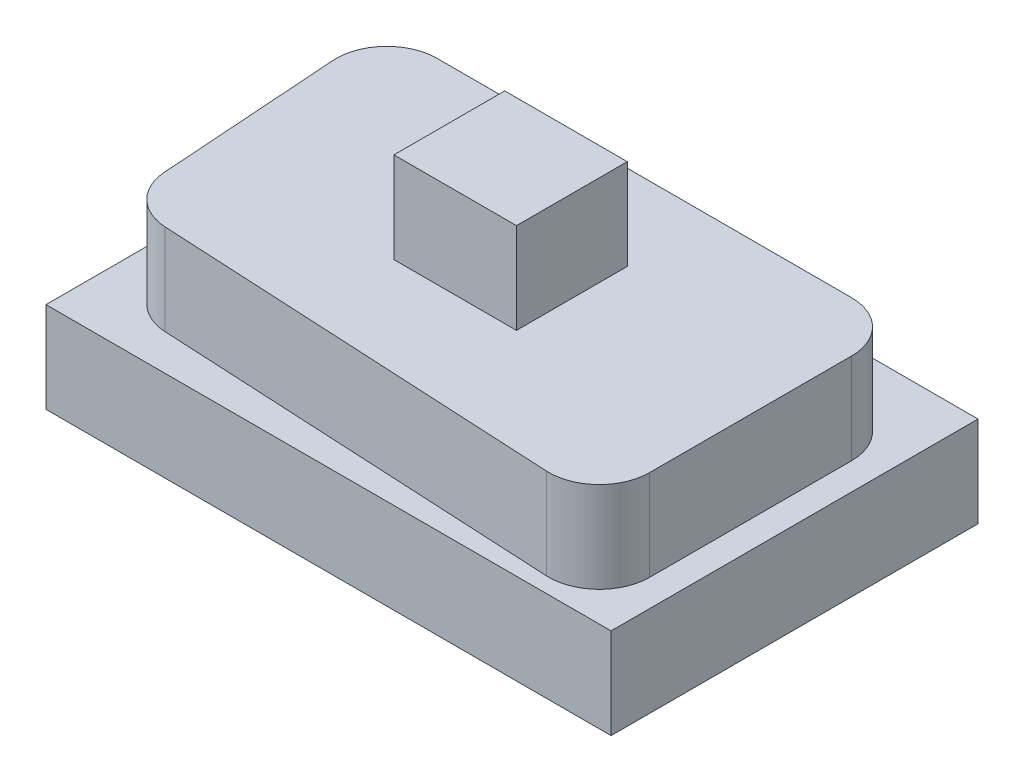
ISO-10303-21;
HEADER;
FILE_DESCRIPTION(('STEP AP214'),'2;1');
FILE_NAME('part.step','',(''),(''),'','','');
FILE_SCHEMA(('AUTOMOTIVE_DESIGN { 1 0 10303 214 1 1 1 1 }'));
ENDSEC;
DATA;
#1=APPLICATION_CONTEXT('core data for automotive mechanical design processes');
#2=APPLICATION_PROTOCOL_DEFINITION('international standard','automotive_design',2000,#1);
#3=PRODUCT_CONTEXT('',#1,'mechanical');
#4=PRODUCT('Part','Part','',(#3));
#5=PRODUCT_RELATED_PRODUCT_CATEGORY('part','',(#4));
#6=PRODUCT_DEFINITION_FORMATION('','',#4);
#7=PRODUCT_DEFINITION_CONTEXT('part definition',#1,'design');
#8=PRODUCT_DEFINITION('design','',#6,#7);
#9=PRODUCT_DEFINITION_SHAPE('','',#8);
#10=(LENGTH_UNIT() NAMED_UNIT(*) SI_UNIT(.MILLI.,.METRE.));
#11=(NAMED_UNIT(*) PLANE_ANGLE_UNIT() SI_UNIT($,.RADIAN.));
#12=(NAMED_UNIT(*) SI_UNIT($,.STERADIAN.) SOLID_ANGLE_UNIT());
#13=UNCERTAINTY_MEASURE_WITH_UNIT(LENGTH_MEASURE(1.E-05),#10,'distance_accuracy_value','');
#14=(GEOMETRIC_REPRESENTATION_CONTEXT(3) GLOBAL_UNCERTAINTY_ASSIGNED_CONTEXT((#13)) GLOBAL_UNIT_ASSIGNED_CONTEXT((#10,
#11,#12)) REPRESENTATION_CONTEXT('',''));
#15=CARTESIAN_POINT('',(0.,0.,0.));
#16=DIRECTION('',(0.,0.,1.));
#17=DIRECTION('',(1.,0.,0.));
#18=AXIS2_PLACEMENT_3D('',#15,#16,#17);
#19=CARTESIAN_POINT('',(0.,9.,0.));
#20=DIRECTION('',(0.,-1.,0.));
#21=DIRECTION('',(0.,0.,-1.));
#22=AXIS2_PLACEMENT_3D('',#19,#20,#21);
#23=PLANE('',#22);
#24=DIRECTION('',(0.,0.,1.));
#25=VECTOR('',#24,1.);
#26=CARTESIAN_POINT('',(0.,9.,0.));
#27=LINE('',#26,#25);
#28=CARTESIAN_POINT('',(0.,9.,-36.3918895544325));
#29=VERTEX_POINT('',#28);
#30=CARTESIAN_POINT('',(0.,9.,0.));
#31=VERTEX_POINT('',#30);
#32=EDGE_CURVE('E198',#29,#31,#27,.T.);
#33=ORIENTED_EDGE('',*,*,#32,.T.);
#34=DIRECTION('',(1.,0.,0.));
#35=VECTOR('',#34,1.);
#36=CARTESIAN_POINT('',(0.,9.,0.));
#37=LINE('',#36,#35);
#38=CARTESIAN_POINT('',(56.0446144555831,9.,0.));
#39=VERTEX_POINT('',#38);
#40=EDGE_CURVE('E201',#31,#39,#37,.T.);
#41=ORIENTED_EDGE('',*,*,#40,.T.);
#42=DIRECTION('',(0.,0.,-1.));
#43=VECTOR('',#42,1.);
#44=CARTESIAN_POINT('',(56.0446144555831,9.,0.));
#45=LINE('',#44,#43);
#46=CARTESIAN_POINT('',(56.0446144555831,9.,-36.3918895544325));
#47=VERTEX_POINT('',#46);
#48=EDGE_CURVE('E204',#39,#47,#45,.T.);
#49=ORIENTED_EDGE('',*,*,#48,.T.);
#50=DIRECTION('',(-1.,0.,0.));
#51=VECTOR('',#50,1.);
#52=CARTESIAN_POINT('',(0.,9.,-36.3918895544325));
#53=LINE('',#52,#51);
#54=EDGE_CURVE('E206',#47,#29,#53,.T.);
#55=ORIENTED_EDGE('',*,*,#54,.T.);
#56=EDGE_LOOP('',(#33,#41,#49,#55));
#57=FACE_BOUND('',#56,.T.);
#58=DIRECTION('',(0.998668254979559,0.,0.0515918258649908));
#59=VECTOR('',#58,1.);
#60=CARTESIAN_POINT('',(3.81,9.,-3.81));
#61=LINE('',#60,#59);
#62=CARTESIAN_POINT('',(8.23375056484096,9.,-3.58146628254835));
#63=VERTEX_POINT('',#62);
#64=CARTESIAN_POINT('',(48.1021339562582,9.,-1.52184069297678));
#65=VERTEX_POINT('',#64);
#66=EDGE_CURVE('E169',#63,#65,#61,.T.);
#67=ORIENTED_EDGE('',*,*,#66,.F.);
#68=CARTESIAN_POINT('',(8.49170969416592,9.,-8.57480755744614));
#69=DIRECTION('',(0.,-1.,0.));
#70=DIRECTION('',(0.,0.,-1.));
#71=AXIS2_PLACEMENT_3D('',#68,#69,#70);
#72=CIRCLE('',#71,5.);
#73=CARTESIAN_POINT('',(3.50367915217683,9.,-8.22904562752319));
#74=VERTEX_POINT('',#73);
#75=EDGE_CURVE('E11',#63,#74,#72,.T.);
#76=ORIENTED_EDGE('',*,*,#75,.T.);
#77=DIRECTION('',(0.0691523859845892,0.,0.997606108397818));
#78=VECTOR('',#77,1.);
#79=CARTESIAN_POINT('',(1.88737663,9.,-31.5461480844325));
#80=LINE('',#79,#78);
#81=CARTESIAN_POINT('',(2.25793590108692,9.,-26.2003861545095));
#82=VERTEX_POINT('',#81);
#83=EDGE_CURVE('E181',#82,#74,#80,.T.);
#84=ORIENTED_EDGE('',*,*,#83,.F.);
#85=CARTESIAN_POINT('',(7.24596644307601,9.,-26.5461480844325));
#86=DIRECTION('',(0.,-1.,0.));
#87=DIRECTION('',(0.,0.,-1.));
#88=AXIS2_PLACEMENT_3D('',#85,#86,#87);
#89=CIRCLE('',#88,5.);
#90=CARTESIAN_POINT('',(7.24596644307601,9.,-31.5461480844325));
#91=VERTEX_POINT('',#90);
#92=EDGE_CURVE('E254',#82,#91,#89,.T.);
#93=ORIENTED_EDGE('',*,*,#92,.T.);
#94=DIRECTION('',(-1.,0.,0.));
#95=VECTOR('',#94,1.);
#96=CARTESIAN_POINT('',(53.3600930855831,9.,-31.5461480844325));
#97=LINE('',#96,#95);
#98=CARTESIAN_POINT('',(48.3600930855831,9.,-31.5461480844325));
#99=VERTEX_POINT('',#98);
#100=EDGE_CURVE('E193',#99,#91,#97,.T.);
#101=ORIENTED_EDGE('',*,*,#100,.F.);
#102=CARTESIAN_POINT('',(48.3600930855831,9.,-26.5461480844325));
#103=DIRECTION('',(0.,-1.,0.));
#104=DIRECTION('',(0.,0.,-1.));
#105=AXIS2_PLACEMENT_3D('',#102,#103,#104);
#106=CIRCLE('',#105,5.);
#107=CARTESIAN_POINT('',(53.3600930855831,9.,-26.5461480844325));
#108=VERTEX_POINT('',#107);
#109=EDGE_CURVE('E256',#99,#108,#106,.T.);
#110=ORIENTED_EDGE('',*,*,#109,.T.);
#111=DIRECTION('',(0.,0.,-1.));
#112=VECTOR('',#111,1.);
#113=CARTESIAN_POINT('',(53.3600930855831,9.,-1.25021124));
#114=LINE('',#113,#112);
#115=CARTESIAN_POINT('',(53.3600930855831,9.,-6.51518196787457));
#116=VERTEX_POINT('',#115);
#117=EDGE_CURVE('E171',#116,#108,#114,.T.);
#118=ORIENTED_EDGE('',*,*,#117,.F.);
#119=CARTESIAN_POINT('',(48.3600930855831,9.,-6.51518196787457));
#120=DIRECTION('',(0.,-1.,0.));
#121=DIRECTION('',(0.,0.,-1.));
#122=AXIS2_PLACEMENT_3D('',#119,#120,#121);
#123=CIRCLE('',#122,5.);
#124=EDGE_CURVE('E40',#116,#65,#123,.T.);
#125=ORIENTED_EDGE('',*,*,#124,.T.);
#126=EDGE_LOOP('',(#67,#76,#84,#93,#101,#110,#118,#125));
#127=FACE_BOUND('',#126,.T.);
#128=ADVANCED_FACE('F32',(#57,#127),#23,.F.);
#129=CARTESIAN_POINT('',(0.,9.,0.));
#130=DIRECTION('',(1.,0.,0.));
#131=DIRECTION('',(0.,0.,-1.));
#132=AXIS2_PLACEMENT_3D('',#129,#130,#131);
#133=PLANE('',#132);
#134=DIRECTION('',(0.,0.,1.));
#135=VECTOR('',#134,1.);
#136=CARTESIAN_POINT('',(0.,0.,0.));
#137=LINE('',#136,#135);
#138=CARTESIAN_POINT('',(0.,0.,-36.3918895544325));
#139=VERTEX_POINT('',#138);
#140=CARTESIAN_POINT('',(0.,0.,0.));
#141=VERTEX_POINT('',#140);
#142=EDGE_CURVE('E189',#139,#141,#137,.T.);
#143=ORIENTED_EDGE('',*,*,#142,.T.);
#144=DIRECTION('',(0.,-1.,0.));
#145=VECTOR('',#144,1.);
#146=CARTESIAN_POINT('',(0.,9.,0.));
#147=LINE('',#146,#145);
#148=EDGE_CURVE('E224',#31,#141,#147,.T.);
#149=ORIENTED_EDGE('',*,*,#148,.F.);
#150=ORIENTED_EDGE('',*,*,#32,.F.);
#151=DIRECTION('',(0.,-1.,0.));
#152=VECTOR('',#151,1.);
#153=CARTESIAN_POINT('',(0.,9.,-36.3918895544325));
#154=LINE('',#153,#152);
#155=EDGE_CURVE('E208',#29,#139,#154,.T.);
#156=ORIENTED_EDGE('',*,*,#155,.T.);
#157=EDGE_LOOP('',(#143,#149,#150,#156));
#158=FACE_BOUND('',#157,.T.);
#159=ADVANCED_FACE('F296',(#158),#133,.F.);
#160=CARTESIAN_POINT('',(0.,9.,0.));
#161=DIRECTION('',(0.,0.,-1.));
#162=DIRECTION('',(-1.,0.,0.));
#163=AXIS2_PLACEMENT_3D('',#160,#161,#162);
#164=PLANE('',#163);
#165=DIRECTION('',(1.,0.,0.));
#166=VECTOR('',#165,1.);
#167=CARTESIAN_POINT('',(0.,0.,0.));
#168=LINE('',#167,#166);
#169=CARTESIAN_POINT('',(56.0446144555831,0.,0.));
#170=VERTEX_POINT('',#169);
#171=EDGE_CURVE('E211',#141,#170,#168,.T.);
#172=ORIENTED_EDGE('',*,*,#171,.T.);
#173=DIRECTION('',(0.,-1.,0.));
#174=VECTOR('',#173,1.);
#175=CARTESIAN_POINT('',(56.0446144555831,9.,0.));
#176=LINE('',#175,#174);
#177=EDGE_CURVE('E221',#39,#170,#176,.T.);
#178=ORIENTED_EDGE('',*,*,#177,.F.);
#179=ORIENTED_EDGE('',*,*,#40,.F.);
#180=ORIENTED_EDGE('',*,*,#148,.T.);
#181=EDGE_LOOP('',(#172,#178,#179,#180));
#182=FACE_BOUND('',#181,.T.);
#183=ADVANCED_FACE('F302',(#182),#164,.F.);
#184=CARTESIAN_POINT('',(56.0446144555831,9.,0.));
#185=DIRECTION('',(-1.,0.,0.));
#186=DIRECTION('',(0.,0.,1.));
#187=AXIS2_PLACEMENT_3D('',#184,#185,#186);
#188=PLANE('',#187);
#189=DIRECTION('',(0.,0.,-1.));
#190=VECTOR('',#189,1.);
#191=CARTESIAN_POINT('',(56.0446144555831,0.,0.));
#192=LINE('',#191,#190);
#193=CARTESIAN_POINT('',(56.0446144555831,0.,-36.3918895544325));
#194=VERTEX_POINT('',#193);
#195=EDGE_CURVE('E213',#170,#194,#192,.T.);
#196=ORIENTED_EDGE('',*,*,#195,.T.);
#197=DIRECTION('',(0.,-1.,0.));
#198=VECTOR('',#197,1.);
#199=CARTESIAN_POINT('',(56.0446144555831,9.,-36.3918895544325));
#200=LINE('',#199,#198);
#201=EDGE_CURVE('E218',#47,#194,#200,.T.);
#202=ORIENTED_EDGE('',*,*,#201,.F.);
#203=ORIENTED_EDGE('',*,*,#48,.F.);
#204=ORIENTED_EDGE('',*,*,#177,.T.);
#205=EDGE_LOOP('',(#196,#202,#203,#204));
#206=FACE_BOUND('',#205,.T.);
#207=ADVANCED_FACE('F315',(#206),#188,.F.);
#208=CARTESIAN_POINT('',(0.,9.,-36.3918895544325));
#209=DIRECTION('',(0.,0.,1.));
#210=DIRECTION('',(1.,0.,0.));
#211=AXIS2_PLACEMENT_3D('',#208,#209,#210);
#212=PLANE('',#211);
#213=DIRECTION('',(-1.,0.,0.));
#214=VECTOR('',#213,1.);
#215=CARTESIAN_POINT('',(0.,0.,-36.3918895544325));
#216=LINE('',#215,#214);
#217=EDGE_CURVE('E202',#194,#139,#216,.T.);
#218=ORIENTED_EDGE('',*,*,#217,.T.);
#219=ORIENTED_EDGE('',*,*,#155,.F.);
#220=ORIENTED_EDGE('',*,*,#54,.F.);
#221=ORIENTED_EDGE('',*,*,#201,.T.);
#222=EDGE_LOOP('',(#218,#219,#220,#221));
#223=FACE_BOUND('',#222,.T.);
#224=ADVANCED_FACE('F311',(#223),#212,.F.);
#225=CARTESIAN_POINT('',(0.,0.,0.));
#226=DIRECTION('',(0.,-1.,0.));
#227=DIRECTION('',(0.,0.,-1.));
#228=AXIS2_PLACEMENT_3D('',#225,#226,#227);
#229=PLANE('',#228);
#230=ORIENTED_EDGE('',*,*,#142,.F.);
#231=ORIENTED_EDGE('',*,*,#217,.F.);
#232=ORIENTED_EDGE('',*,*,#195,.F.);
#233=ORIENTED_EDGE('',*,*,#171,.F.);
#234=EDGE_LOOP('',(#230,#231,#232,#233));
#235=FACE_BOUND('',#234,.T.);
#236=ADVANCED_FACE('F308',(#235),#229,.T.);
#237=CARTESIAN_POINT('',(3.81,18.,-3.81));
#238=DIRECTION('',(0.0515918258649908,0.,-0.998668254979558));
#239=DIRECTION('',(-0.998668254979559,0.,-0.0515918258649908));
#240=AXIS2_PLACEMENT_3D('',#237,#238,#239);
#241=PLANE('',#240);
#242=ORIENTED_EDGE('',*,*,#66,.T.);
#243=DIRECTION('',(0.,-1.,0.));
#244=VECTOR('',#243,1.);
#245=CARTESIAN_POINT('',(48.1021339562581,18.,-1.52184069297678));
#246=LINE('',#245,#244);
#247=CARTESIAN_POINT('',(48.1021339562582,18.,-1.52184069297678));
#248=VERTEX_POINT('',#247);
#249=EDGE_CURVE('E252',#65,#248,#246,.F.);
#250=ORIENTED_EDGE('',*,*,#249,.T.);
#251=DIRECTION('',(0.998668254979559,0.,0.0515918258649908));
#252=VECTOR('',#251,1.);
#253=CARTESIAN_POINT('',(3.81,18.,-3.81));
#254=LINE('',#253,#252);
#255=CARTESIAN_POINT('',(8.23375056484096,18.,-3.58146628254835));
#256=VERTEX_POINT('',#255);
#257=EDGE_CURVE('E177',#256,#248,#254,.T.);
#258=ORIENTED_EDGE('',*,*,#257,.F.);
#259=DIRECTION('',(0.,-1.,0.));
#260=VECTOR('',#259,1.);
#261=CARTESIAN_POINT('',(8.23375056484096,18.,-3.58146628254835));
#262=LINE('',#261,#260);
#263=EDGE_CURVE('E250',#256,#63,#262,.T.);
#264=ORIENTED_EDGE('',*,*,#263,.T.);
#265=EDGE_LOOP('',(#242,#250,#258,#264));
#266=FACE_BOUND('',#265,.T.);
#267=ADVANCED_FACE('F285',(#266),#241,.F.);
#268=CARTESIAN_POINT('',(53.3600930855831,18.,-1.25021124));
#269=DIRECTION('',(-1.,0.,0.));
#270=DIRECTION('',(0.,0.,1.));
#271=AXIS2_PLACEMENT_3D('',#268,#269,#270);
#272=PLANE('',#271);
#273=ORIENTED_EDGE('',*,*,#117,.T.);
#274=DIRECTION('',(0.,-1.,0.));
#275=VECTOR('',#274,1.);
#276=CARTESIAN_POINT('',(53.3600930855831,18.,-26.5461480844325));
#277=LINE('',#276,#275);
#278=CARTESIAN_POINT('',(53.3600930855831,18.,-26.5461480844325));
#279=VERTEX_POINT('',#278);
#280=EDGE_CURVE('E248',#108,#279,#277,.F.);
#281=ORIENTED_EDGE('',*,*,#280,.T.);
#282=DIRECTION('',(0.,0.,-1.));
#283=VECTOR('',#282,1.);
#284=CARTESIAN_POINT('',(53.3600930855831,18.,-1.25021124));
#285=LINE('',#284,#283);
#286=CARTESIAN_POINT('',(53.3600930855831,18.,-6.51518196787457));
#287=VERTEX_POINT('',#286);
#288=EDGE_CURVE('E180',#287,#279,#285,.T.);
#289=ORIENTED_EDGE('',*,*,#288,.F.);
#290=DIRECTION('',(0.,-1.,0.));
#291=VECTOR('',#290,1.);
#292=CARTESIAN_POINT('',(53.3600930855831,18.,-6.51518196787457));
#293=LINE('',#292,#291);
#294=EDGE_CURVE('E245',#287,#116,#293,.T.);
#295=ORIENTED_EDGE('',*,*,#294,.T.);
#296=EDGE_LOOP('',(#273,#281,#289,#295));
#297=FACE_BOUND('',#296,.T.);
#298=ADVANCED_FACE('F262',(#297),#272,.F.);
#299=CARTESIAN_POINT('',(53.3600930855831,18.,-31.5461480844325));
#300=DIRECTION('',(0.,0.,1.));
#301=DIRECTION('',(1.,0.,0.));
#302=AXIS2_PLACEMENT_3D('',#299,#300,#301);
#303=PLANE('',#302);
#304=ORIENTED_EDGE('',*,*,#100,.T.);
#305=DIRECTION('',(0.,-1.,0.));
#306=VECTOR('',#305,1.);
#307=CARTESIAN_POINT('',(7.24596644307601,18.,-31.5461480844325));
#308=LINE('',#307,#306);
#309=CARTESIAN_POINT('',(7.24596644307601,18.,-31.5461480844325));
#310=VERTEX_POINT('',#309);
#311=EDGE_CURVE('E235',#91,#310,#308,.F.);
#312=ORIENTED_EDGE('',*,*,#311,.T.);
#313=DIRECTION('',(-1.,0.,0.));
#314=VECTOR('',#313,1.);
#315=CARTESIAN_POINT('',(53.3600930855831,18.,-31.5461480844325));
#316=LINE('',#315,#314);
#317=CARTESIAN_POINT('',(48.3600930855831,18.,-31.5461480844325));
#318=VERTEX_POINT('',#317);
#319=EDGE_CURVE('E184',#318,#310,#316,.T.);
#320=ORIENTED_EDGE('',*,*,#319,.F.);
#321=DIRECTION('',(0.,-1.,0.));
#322=VECTOR('',#321,1.);
#323=CARTESIAN_POINT('',(48.3600930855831,18.,-31.5461480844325));
#324=LINE('',#323,#322);
#325=EDGE_CURVE('E232',#318,#99,#324,.T.);
#326=ORIENTED_EDGE('',*,*,#325,.T.);
#327=EDGE_LOOP('',(#304,#312,#320,#326));
#328=FACE_BOUND('',#327,.T.);
#329=ADVANCED_FACE('F272',(#328),#303,.F.);
#330=CARTESIAN_POINT('',(1.88737663,18.,-31.5461480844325));
#331=DIRECTION('',(0.997606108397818,0.,-0.0691523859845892));
#332=DIRECTION('',(-0.0691523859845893,0.,-0.997606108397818));
#333=AXIS2_PLACEMENT_3D('',#330,#331,#332);
#334=PLANE('',#333);
#335=DIRECTION('',(0.0691523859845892,0.,0.997606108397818));
#336=VECTOR('',#335,1.);
#337=CARTESIAN_POINT('',(1.88737663,18.,-31.5461480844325));
#338=LINE('',#337,#336);
#339=CARTESIAN_POINT('',(2.25793590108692,18.,-26.2003861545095));
#340=VERTEX_POINT('',#339);
#341=CARTESIAN_POINT('',(3.50367915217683,18.,-8.22904562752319));
#342=VERTEX_POINT('',#341);
#343=EDGE_CURVE('E187',#340,#342,#338,.T.);
#344=ORIENTED_EDGE('',*,*,#343,.F.);
#345=DIRECTION('',(0.,-1.,0.));
#346=VECTOR('',#345,1.);
#347=CARTESIAN_POINT('',(2.25793590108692,18.,-26.2003861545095));
#348=LINE('',#347,#346);
#349=EDGE_CURVE('E229',#340,#82,#348,.T.);
#350=ORIENTED_EDGE('',*,*,#349,.T.);
#351=ORIENTED_EDGE('',*,*,#83,.T.);
#352=DIRECTION('',(0.,-1.,0.));
#353=VECTOR('',#352,1.);
#354=CARTESIAN_POINT('',(3.50367915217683,18.,-8.2290456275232));
#355=LINE('',#354,#353);
#356=EDGE_CURVE('E227',#74,#342,#355,.F.);
#357=ORIENTED_EDGE('',*,*,#356,.T.);
#358=EDGE_LOOP('',(#344,#350,#351,#357));
#359=FACE_BOUND('',#358,.T.);
#360=ADVANCED_FACE('F280',(#359),#334,.F.);
#361=CARTESIAN_POINT('',(0.,18.,0.));
#362=DIRECTION('',(0.,1.,0.));
#363=DIRECTION('',(0.,0.,1.));
#364=AXIS2_PLACEMENT_3D('',#361,#362,#363);
#365=PLANE('',#364);
#366=DIRECTION('',(0.,0.,1.));
#367=VECTOR('',#366,1.);
#368=CARTESIAN_POINT('',(22.39082313,18.,-23.10569041));
#369=LINE('',#368,#367);
#370=CARTESIAN_POINT('',(22.39082313,18.,-23.10569041));
#371=VERTEX_POINT('',#370);
#372=CARTESIAN_POINT('',(22.39082313,18.,-12.11705413));
#373=VERTEX_POINT('',#372);
#374=EDGE_CURVE('E168',#371,#373,#369,.T.);
#375=ORIENTED_EDGE('',*,*,#374,.F.);
#376=DIRECTION('',(-1.,0.,0.));
#377=VECTOR('',#376,1.);
#378=CARTESIAN_POINT('',(22.39082313,18.,-23.10569041));
#379=LINE('',#378,#377);
#380=CARTESIAN_POINT('',(34.5461071,18.,-23.10569041));
#381=VERTEX_POINT('',#380);
#382=EDGE_CURVE('E165',#381,#371,#379,.T.);
#383=ORIENTED_EDGE('',*,*,#382,.F.);
#384=DIRECTION('',(0.,0.,-1.));
#385=VECTOR('',#384,1.);
#386=CARTESIAN_POINT('',(34.5461071,18.,-23.10569041));
#387=LINE('',#386,#385);
#388=CARTESIAN_POINT('',(34.5461071,18.,-12.11705413));
#389=VERTEX_POINT('',#388);
#390=EDGE_CURVE('E470',#389,#381,#387,.T.);
#391=ORIENTED_EDGE('',*,*,#390,.F.);
#392=DIRECTION('',(1.,0.,0.));
#393=VECTOR('',#392,1.);
#394=CARTESIAN_POINT('',(22.39082313,18.,-12.11705413));
#395=LINE('',#394,#393);
#396=EDGE_CURVE('E465',#373,#389,#395,.T.);
#397=ORIENTED_EDGE('',*,*,#396,.F.);
#398=EDGE_LOOP('',(#375,#383,#391,#397));
#399=FACE_BOUND('',#398,.T.);
#400=ORIENTED_EDGE('',*,*,#319,.T.);
#401=CARTESIAN_POINT('',(7.24596644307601,18.,-26.5461480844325));
#402=DIRECTION('',(0.,1.,0.));
#403=DIRECTION('',(0.,0.,1.));
#404=AXIS2_PLACEMENT_3D('',#401,#402,#403);
#405=CIRCLE('',#404,5.);
#406=EDGE_CURVE('E243',#310,#340,#405,.T.);
#407=ORIENTED_EDGE('',*,*,#406,.T.);
#408=ORIENTED_EDGE('',*,*,#343,.T.);
#409=CARTESIAN_POINT('',(8.49170969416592,18.,-8.57480755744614));
#410=DIRECTION('',(0.,1.,0.));
#411=DIRECTION('',(0.,0.,1.));
#412=AXIS2_PLACEMENT_3D('',#409,#410,#411);
#413=CIRCLE('',#412,5.);
#414=EDGE_CURVE('E237',#342,#256,#413,.T.);
#415=ORIENTED_EDGE('',*,*,#414,.T.);
#416=ORIENTED_EDGE('',*,*,#257,.T.);
#417=CARTESIAN_POINT('',(48.3600930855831,18.,-6.51518196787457));
#418=DIRECTION('',(0.,1.,0.));
#419=DIRECTION('',(0.,0.,1.));
#420=AXIS2_PLACEMENT_3D('',#417,#418,#419);
#421=CIRCLE('',#420,5.);
#422=EDGE_CURVE('E239',#248,#287,#421,.T.);
#423=ORIENTED_EDGE('',*,*,#422,.T.);
#424=ORIENTED_EDGE('',*,*,#288,.T.);
#425=CARTESIAN_POINT('',(48.3600930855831,18.,-26.5461480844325));
#426=DIRECTION('',(0.,1.,0.));
#427=DIRECTION('',(0.,0.,1.));
#428=AXIS2_PLACEMENT_3D('',#425,#426,#427);
#429=CIRCLE('',#428,5.);
#430=EDGE_CURVE('E241',#279,#318,#429,.T.);
#431=ORIENTED_EDGE('',*,*,#430,.T.);
#432=EDGE_LOOP('',(#400,#407,#408,#415,#416,#423,#424,#431));
#433=FACE_BOUND('',#432,.T.);
#434=ADVANCED_FACE('F269',(#399,#433),#365,.T.);
#435=CARTESIAN_POINT('',(22.39082313,27.,-23.10569041));
#436=DIRECTION('',(1.,0.,0.));
#437=DIRECTION('',(0.,0.,-1.));
#438=AXIS2_PLACEMENT_3D('',#435,#436,#437);
#439=PLANE('',#438);
#440=ORIENTED_EDGE('',*,*,#374,.T.);
#441=DIRECTION('',(0.,-1.,0.));
#442=VECTOR('',#441,1.);
#443=CARTESIAN_POINT('',(22.39082313,27.,-12.11705413));
#444=LINE('',#443,#442);
#445=CARTESIAN_POINT('',(22.39082313,27.,-12.11705413));
#446=VERTEX_POINT('',#445);
#447=EDGE_CURVE('E149',#446,#373,#444,.T.);
#448=ORIENTED_EDGE('',*,*,#447,.F.);
#449=DIRECTION('',(0.,0.,1.));
#450=VECTOR('',#449,1.);
#451=CARTESIAN_POINT('',(22.39082313,27.,-23.10569041));
#452=LINE('',#451,#450);
#453=CARTESIAN_POINT('',(22.39082313,27.,-23.10569041));
#454=VERTEX_POINT('',#453);
#455=EDGE_CURVE('E156',#454,#446,#452,.T.);
#456=ORIENTED_EDGE('',*,*,#455,.F.);
#457=DIRECTION('',(0.,-1.,0.));
#458=VECTOR('',#457,1.);
#459=CARTESIAN_POINT('',(22.39082313,27.,-23.10569041));
#460=LINE('',#459,#458);
#461=EDGE_CURVE('E468',#454,#371,#460,.T.);
#462=ORIENTED_EDGE('',*,*,#461,.T.);
#463=EDGE_LOOP('',(#440,#448,#456,#462));
#464=FACE_BOUND('',#463,.T.);
#465=ADVANCED_FACE('F167',(#464),#439,.F.);
#466=CARTESIAN_POINT('',(22.39082313,27.,-12.11705413));
#467=DIRECTION('',(0.,0.,-1.));
#468=DIRECTION('',(-1.,0.,0.));
#469=AXIS2_PLACEMENT_3D('',#466,#467,#468);
#470=PLANE('',#469);
#471=ORIENTED_EDGE('',*,*,#396,.T.);
#472=DIRECTION('',(0.,-1.,0.));
#473=VECTOR('',#472,1.);
#474=CARTESIAN_POINT('',(34.5461071,27.,-12.11705413));
#475=LINE('',#474,#473);
#476=CARTESIAN_POINT('',(34.5461071,27.,-12.11705413));
#477=VERTEX_POINT('',#476);
#478=EDGE_CURVE('E152',#477,#389,#475,.T.);
#479=ORIENTED_EDGE('',*,*,#478,.F.);
#480=DIRECTION('',(1.,0.,0.));
#481=VECTOR('',#480,1.);
#482=CARTESIAN_POINT('',(22.39082313,27.,-12.11705413));
#483=LINE('',#482,#481);
#484=EDGE_CURVE('E144',#446,#477,#483,.T.);
#485=ORIENTED_EDGE('',*,*,#484,.F.);
#486=ORIENTED_EDGE('',*,*,#447,.T.);
#487=EDGE_LOOP('',(#471,#479,#485,#486));
#488=FACE_BOUND('',#487,.T.);
#489=ADVANCED_FACE('F147',(#488),#470,.F.);
#490=CARTESIAN_POINT('',(34.5461071,27.,-23.10569041));
#491=DIRECTION('',(-1.,0.,0.));
#492=DIRECTION('',(0.,0.,1.));
#493=AXIS2_PLACEMENT_3D('',#490,#491,#492);
#494=PLANE('',#493);
#495=ORIENTED_EDGE('',*,*,#390,.T.);
#496=DIRECTION('',(0.,-1.,0.));
#497=VECTOR('',#496,1.);
#498=CARTESIAN_POINT('',(34.5461071,27.,-23.10569041));
#499=LINE('',#498,#497);
#500=CARTESIAN_POINT('',(34.5461071,27.,-23.10569041));
#501=VERTEX_POINT('',#500);
#502=EDGE_CURVE('E173',#501,#381,#499,.T.);
#503=ORIENTED_EDGE('',*,*,#502,.F.);
#504=DIRECTION('',(0.,0.,-1.));
#505=VECTOR('',#504,1.);
#506=CARTESIAN_POINT('',(34.5461071,27.,-23.10569041));
#507=LINE('',#506,#505);
#508=EDGE_CURVE('E155',#477,#501,#507,.T.);
#509=ORIENTED_EDGE('',*,*,#508,.F.);
#510=ORIENTED_EDGE('',*,*,#478,.T.);
#511=EDGE_LOOP('',(#495,#503,#509,#510));
#512=FACE_BOUND('',#511,.T.);
#513=ADVANCED_FACE('F332',(#512),#494,.F.);
#514=CARTESIAN_POINT('',(22.39082313,27.,-23.10569041));
#515=DIRECTION('',(0.,0.,1.));
#516=DIRECTION('',(1.,0.,0.));
#517=AXIS2_PLACEMENT_3D('',#514,#515,#516);
#518=PLANE('',#517);
#519=ORIENTED_EDGE('',*,*,#382,.T.);
#520=ORIENTED_EDGE('',*,*,#461,.F.);
#521=DIRECTION('',(-1.,0.,0.));
#522=VECTOR('',#521,1.);
#523=CARTESIAN_POINT('',(22.39082313,27.,-23.10569041));
#524=LINE('',#523,#522);
#525=EDGE_CURVE('E161',#501,#454,#524,.T.);
#526=ORIENTED_EDGE('',*,*,#525,.F.);
#527=ORIENTED_EDGE('',*,*,#502,.T.);
#528=EDGE_LOOP('',(#519,#520,#526,#527));
#529=FACE_BOUND('',#528,.T.);
#530=ADVANCED_FACE('F327',(#529),#518,.F.);
#531=CARTESIAN_POINT('',(0.,27.,0.));
#532=DIRECTION('',(0.,1.,0.));
#533=DIRECTION('',(0.,0.,1.));
#534=AXIS2_PLACEMENT_3D('',#531,#532,#533);
#535=PLANE('',#534);
#536=ORIENTED_EDGE('',*,*,#455,.T.);
#537=ORIENTED_EDGE('',*,*,#484,.T.);
#538=ORIENTED_EDGE('',*,*,#508,.T.);
#539=ORIENTED_EDGE('',*,*,#525,.T.);
#540=EDGE_LOOP('',(#536,#537,#538,#539));
#541=FACE_BOUND('',#540,.T.);
#542=ADVANCED_FACE('F159',(#541),#535,.T.);
#543=CARTESIAN_POINT('',(7.24596644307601,18.,-26.5461480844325));
#544=DIRECTION('',(0.,-1.,0.));
#545=DIRECTION('',(0.,0.,-1.));
#546=AXIS2_PLACEMENT_3D('',#543,#544,#545);
#547=CYLINDRICAL_SURFACE('',#546,5.);
#548=ORIENTED_EDGE('',*,*,#406,.F.);
#549=ORIENTED_EDGE('',*,*,#311,.F.);
#550=ORIENTED_EDGE('',*,*,#92,.F.);
#551=ORIENTED_EDGE('',*,*,#349,.F.);
#552=EDGE_LOOP('',(#548,#549,#550,#551));
#553=FACE_BOUND('',#552,.T.);
#554=ADVANCED_FACE('F275',(#553),#547,.T.);
#555=CARTESIAN_POINT('',(48.3600930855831,18.,-26.5461480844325));
#556=DIRECTION('',(0.,-1.,0.));
#557=DIRECTION('',(0.,0.,-1.));
#558=AXIS2_PLACEMENT_3D('',#555,#556,#557);
#559=CYLINDRICAL_SURFACE('',#558,5.);
#560=ORIENTED_EDGE('',*,*,#430,.F.);
#561=ORIENTED_EDGE('',*,*,#280,.F.);
#562=ORIENTED_EDGE('',*,*,#109,.F.);
#563=ORIENTED_EDGE('',*,*,#325,.F.);
#564=EDGE_LOOP('',(#560,#561,#562,#563));
#565=FACE_BOUND('',#564,.T.);
#566=ADVANCED_FACE('F266',(#565),#559,.T.);
#567=CARTESIAN_POINT('',(48.3600930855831,18.,-6.51518196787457));
#568=DIRECTION('',(0.,-1.,0.));
#569=DIRECTION('',(0.,0.,-1.));
#570=AXIS2_PLACEMENT_3D('',#567,#568,#569);
#571=CYLINDRICAL_SURFACE('',#570,5.);
#572=ORIENTED_EDGE('',*,*,#422,.F.);
#573=ORIENTED_EDGE('',*,*,#249,.F.);
#574=ORIENTED_EDGE('',*,*,#124,.F.);
#575=ORIENTED_EDGE('',*,*,#294,.F.);
#576=EDGE_LOOP('',(#572,#573,#574,#575));
#577=FACE_BOUND('',#576,.T.);
#578=ADVANCED_FACE('F288',(#577),#571,.T.);
#579=CARTESIAN_POINT('',(8.49170969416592,18.,-8.57480755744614));
#580=DIRECTION('',(0.,-1.,0.));
#581=DIRECTION('',(0.,0.,-1.));
#582=AXIS2_PLACEMENT_3D('',#579,#580,#581);
#583=CYLINDRICAL_SURFACE('',#582,5.);
#584=ORIENTED_EDGE('',*,*,#414,.F.);
#585=ORIENTED_EDGE('',*,*,#356,.F.);
#586=ORIENTED_EDGE('',*,*,#75,.F.);
#587=ORIENTED_EDGE('',*,*,#263,.F.);
#588=EDGE_LOOP('',(#584,#585,#586,#587));
#589=FACE_BOUND('',#588,.T.);
#590=ADVANCED_FACE('F34',(#589),#583,.T.);
#591=CLOSED_SHELL('',(#128,#159,#183,#207,#224,#236,#267,#298,#329,#360,#434,#465,#489,#513,
#530,#542,#554,#566,#578,#590));
#592=MANIFOLD_SOLID_BREP('B2',#591);
#593=ADVANCED_BREP_SHAPE_REPRESENTATION('',(#18,#592),#14);
#594=SHAPE_DEFINITION_REPRESENTATION(#9,#593);
ENDSEC;
END-ISO-10303-21;
